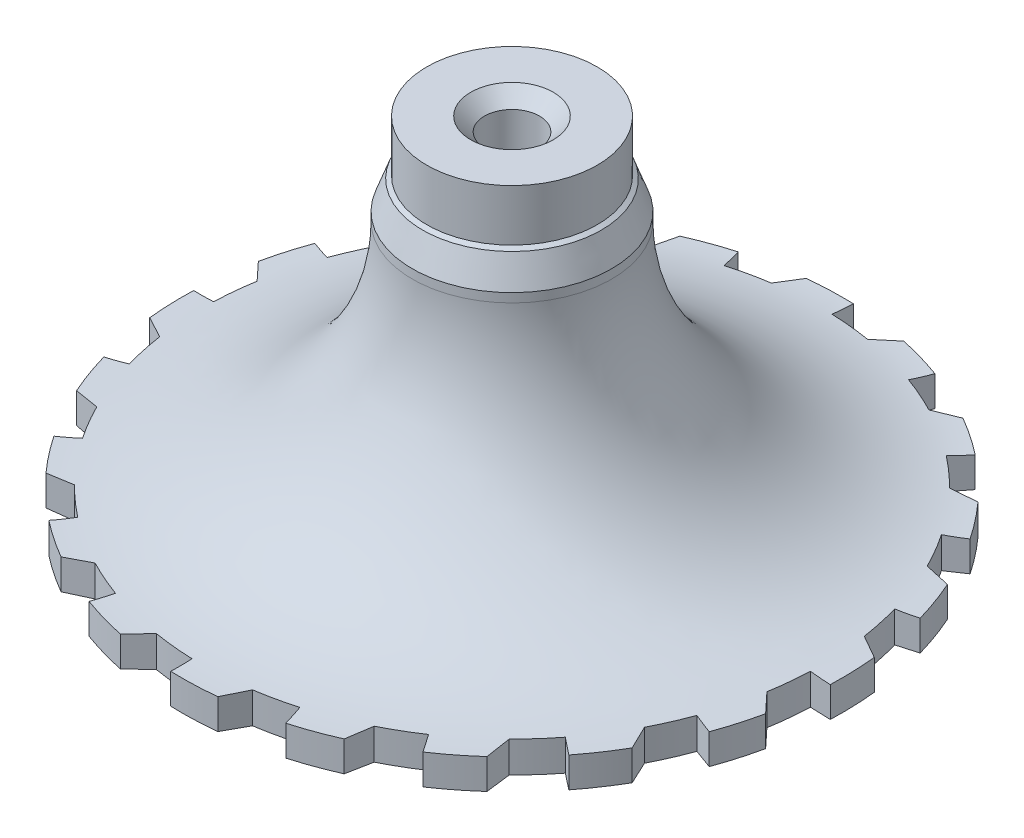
from build123d import *

# Parameters (mm, degrees)
MAIN_TOOTH_REACH            = 55.992
MAIN_TOOTH_END_MAJOR_RADIUS = 30.48
MAIN_TOOTH_END_MINOR_RADIUS = 21.2725
CIRPATTERN4_COUNT           = 20


with BuildPart() as part:
    # Sketch1 → Revolve Body (revolve)
    with BuildSketch(Plane.XY, mode=Mode.PRIVATE) as revolve_body_sk:
        with BuildLine():
            Line((3.81, 32.512), (7.874, 32.512))
            Line((7.874, 32.512), (7.874, 27.7495))
            Line((7.874, 27.7495), (8.255, 27.508972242))
            Line((8.255, 27.508972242), (9.2075, 24.892))
            Line((9.2075, 24.892), (9.2075, 24.0665))
            ThreePointArc((9.2075, 24.0665), (15.438070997, 9.024570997), (30.48, 2.794))
            Line((30.48, 2.794), (30.48, 0))
            Line((30.48, 0), (24.765, 0))
            Line((24.765, 0), (24.765, 1.27))
            Line((24.765, 1.27), (11.1125, 1.27))
            Line((11.1125, 1.27), (10.72388, 0.88138))
            Line((10.72388, 0.88138), (2.54, 0.88138))
            Line((2.54, 0.88138), (2.54, 31.242))
            Line((2.54, 31.242), (3.81, 32.512))
        make_face()
    revolve(revolve_body_sk.sketch.rotate(Axis((0, 0, 0), (0, 1, 0)), 90), axis=Axis((0, 0, 0), (0, 1, 0)))

    # Main Tooth: up to this torus (the profile starts outside it)
    main_tooth_end = Plane(origin=(0, 24.0665, 0), z_dir=(0, -1, 0)) * Torus(MAIN_TOOTH_END_MAJOR_RADIUS, MAIN_TOOTH_END_MINOR_RADIUS, mode=Mode.PRIVATE)
    # Sketch2 → Main Tooth (cut, up to the surface)
    with BuildSketch(Plane(origin=(0, 0, 0), x_dir=(-1, 0, 0), z_dir=(0, 1, 0)), mode=Mode.PRIVATE) as main_tooth_sk1:
        with BuildLine():
            Line((-28.641831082, 10.424773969), (-26.851716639, 9.773225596))
            ThreePointArc((-26.851716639, 9.773225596), (-26.168461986, 11.477901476), (-25.377116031, 13.135166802))
            Line((-25.377116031, 13.135166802), (-26.375507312, 15.276223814))
            ThreePointArc((-26.375507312, 15.276223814), (-27.615412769, 12.900363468), (-28.641831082, 10.424773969))
        make_face()
    main_tooth_tool1 = extrude(main_tooth_sk1.sketch, amount=MAIN_TOOTH_REACH, mode=Mode.PRIVATE) - main_tooth_end
    main_tooth = main_tooth_tool1.solids().sort_by_distance((26.910353, 0, 12.223474))[0]
    add(main_tooth, mode=Mode.SUBTRACT)

    # CirPattern4: Main Tooth ×20 about axis
    cirpattern4_axis = Axis((0, 0, 0), (0, 1, 0))
    for i in range(1, CIRPATTERN4_COUNT):
        add(main_tooth.rotate(cirpattern4_axis, i * 360 / CIRPATTERN4_COUNT), mode=Mode.SUBTRACT)


solid = part.part
